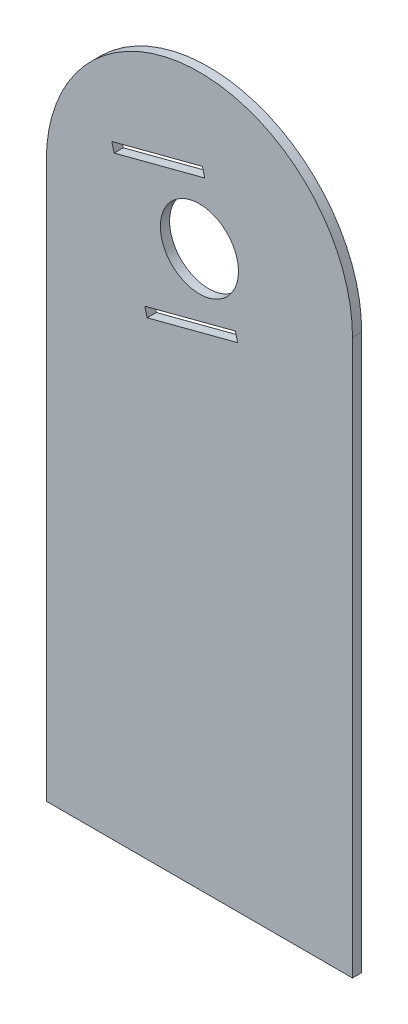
ISO-10303-21;
HEADER;
FILE_DESCRIPTION(('STEP AP214'),'2;1');
FILE_NAME('part.step','',(''),(''),'','','');
FILE_SCHEMA(('AUTOMOTIVE_DESIGN { 1 0 10303 214 1 1 1 1 }'));
ENDSEC;
DATA;
#1=APPLICATION_CONTEXT('core data for automotive mechanical design processes');
#2=APPLICATION_PROTOCOL_DEFINITION('international standard','automotive_design',2000,#1);
#3=PRODUCT_CONTEXT('',#1,'mechanical');
#4=PRODUCT('Part','Part','',(#3));
#5=PRODUCT_RELATED_PRODUCT_CATEGORY('part','',(#4));
#6=PRODUCT_DEFINITION_FORMATION('','',#4);
#7=PRODUCT_DEFINITION_CONTEXT('part definition',#1,'design');
#8=PRODUCT_DEFINITION('design','',#6,#7);
#9=PRODUCT_DEFINITION_SHAPE('','',#8);
#10=(LENGTH_UNIT() NAMED_UNIT(*) SI_UNIT(.MILLI.,.METRE.));
#11=(NAMED_UNIT(*) PLANE_ANGLE_UNIT() SI_UNIT($,.RADIAN.));
#12=(NAMED_UNIT(*) SI_UNIT($,.STERADIAN.) SOLID_ANGLE_UNIT());
#13=UNCERTAINTY_MEASURE_WITH_UNIT(LENGTH_MEASURE(1.E-05),#10,'distance_accuracy_value','');
#14=(GEOMETRIC_REPRESENTATION_CONTEXT(3) GLOBAL_UNCERTAINTY_ASSIGNED_CONTEXT((#13)) GLOBAL_UNIT_ASSIGNED_CONTEXT((#10,
#11,#12)) REPRESENTATION_CONTEXT('',''));
#15=CARTESIAN_POINT('',(0.,0.,0.));
#16=DIRECTION('',(0.,0.,1.));
#17=DIRECTION('',(1.,0.,0.));
#18=AXIS2_PLACEMENT_3D('',#15,#16,#17);
#19=CARTESIAN_POINT('',(-59.4530686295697,-35.0116548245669,1.524));
#20=DIRECTION('',(0.,0.,1.));
#21=DIRECTION('',(1.,0.,0.));
#22=AXIS2_PLACEMENT_3D('',#19,#20,#21);
#23=PLANE('',#22);
#24=DIRECTION('',(0.253234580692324,-0.967404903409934,0.));
#25=VECTOR('',#24,1.);
#26=CARTESIAN_POINT('',(-73.9882357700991,-26.8477322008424,1.524));
#27=LINE('',#26,#25);
#28=CARTESIAN_POINT('',(-73.9882357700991,-26.8477322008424,1.524));
#29=VERTEX_POINT('',#28);
#30=CARTESIAN_POINT('',(-73.602306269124,-28.3220572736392,1.524));
#31=VERTEX_POINT('',#30);
#32=EDGE_CURVE('E159',#29,#31,#27,.T.);
#33=ORIENTED_EDGE('',*,*,#32,.F.);
#34=DIRECTION('',(-0.967404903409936,-0.253234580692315,0.));
#35=VECTOR('',#34,1.);
#36=CARTESIAN_POINT('',(-58.9582136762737,-22.9133699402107,1.524));
#37=LINE('',#36,#35);
#38=CARTESIAN_POINT('',(-58.9582136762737,-22.9133699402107,1.524));
#39=VERTEX_POINT('',#38);
#40=EDGE_CURVE('E157',#39,#29,#37,.T.);
#41=ORIENTED_EDGE('',*,*,#40,.F.);
#42=DIRECTION('',(-0.253234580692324,0.967404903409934,0.));
#43=VECTOR('',#42,1.);
#44=CARTESIAN_POINT('',(-58.5722841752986,-24.3876950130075,1.524));
#45=LINE('',#44,#43);
#46=CARTESIAN_POINT('',(-58.5722841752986,-24.3876950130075,1.524));
#47=VERTEX_POINT('',#46);
#48=EDGE_CURVE('E165',#47,#39,#45,.T.);
#49=ORIENTED_EDGE('',*,*,#48,.F.);
#50=DIRECTION('',(0.967404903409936,0.253234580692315,0.));
#51=VECTOR('',#50,1.);
#52=CARTESIAN_POINT('',(-73.602306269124,-28.3220572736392,1.524));
#53=LINE('',#52,#51);
#54=EDGE_CURVE('E162',#31,#47,#53,.T.);
#55=ORIENTED_EDGE('',*,*,#54,.F.);
#56=EDGE_LOOP('',(#33,#41,#49,#55));
#57=FACE_BOUND('',#56,.T.);
#58=CARTESIAN_POINT('',(-59.4530686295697,-35.0116548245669,1.524));
#59=DIRECTION('',(0.,0.,1.));
#60=DIRECTION('',(1.,0.,0.));
#61=AXIS2_PLACEMENT_3D('',#58,#59,#60);
#62=CIRCLE('',#61,25.4);
#63=CARTESIAN_POINT('',(-34.0530686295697,-35.0116548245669,1.524));
#64=VERTEX_POINT('',#63);
#65=CARTESIAN_POINT('',(-84.8530686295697,-35.0116548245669,1.524));
#66=VERTEX_POINT('',#65);
#67=EDGE_CURVE('E194',#64,#66,#62,.T.);
#68=ORIENTED_EDGE('',*,*,#67,.T.);
#69=DIRECTION('',(0.,-1.,0.));
#70=VECTOR('',#69,1.);
#71=CARTESIAN_POINT('',(-84.8530686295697,-35.0116548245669,1.524));
#72=LINE('',#71,#70);
#73=CARTESIAN_POINT('',(-84.8530686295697,-127.07412463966,1.524));
#74=VERTEX_POINT('',#73);
#75=EDGE_CURVE('E197',#66,#74,#72,.T.);
#76=ORIENTED_EDGE('',*,*,#75,.T.);
#77=DIRECTION('',(1.,0.,0.));
#78=VECTOR('',#77,1.);
#79=CARTESIAN_POINT('',(-34.0530686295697,-127.07412463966,1.524));
#80=LINE('',#79,#78);
#81=CARTESIAN_POINT('',(-34.0530686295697,-127.07412463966,1.524));
#82=VERTEX_POINT('',#81);
#83=EDGE_CURVE('E200',#74,#82,#80,.T.);
#84=ORIENTED_EDGE('',*,*,#83,.T.);
#85=DIRECTION('',(0.,1.,0.));
#86=VECTOR('',#85,1.);
#87=CARTESIAN_POINT('',(-34.0530686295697,-35.0116548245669,1.524));
#88=LINE('',#87,#86);
#89=EDGE_CURVE('E202',#82,#64,#88,.T.);
#90=ORIENTED_EDGE('',*,*,#89,.T.);
#91=EDGE_LOOP('',(#68,#76,#84,#90));
#92=FACE_BOUND('',#91,.T.);
#93=CARTESIAN_POINT('',(-59.4530686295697,-35.0116548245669,1.524));
#94=DIRECTION('',(0.,0.,1.));
#95=DIRECTION('',(1.,0.,0.));
#96=AXIS2_PLACEMENT_3D('',#93,#94,#95);
#97=CIRCLE('',#96,6.477);
#98=CARTESIAN_POINT('',(-65.9300686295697,-35.0116548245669,1.524));
#99=VERTEX_POINT('',#98);
#100=EDGE_CURVE('E188',#99,#99,#97,.T.);
#101=ORIENTED_EDGE('',*,*,#100,.F.);
#102=EDGE_LOOP('',(#101));
#103=FACE_BOUND('',#102,.T.);
#104=DIRECTION('',(-0.253234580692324,0.967404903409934,0.));
#105=VECTOR('',#104,1.);
#106=CARTESIAN_POINT('',(-53.0939968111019,-45.3158085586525,1.524));
#107=LINE('',#106,#105);
#108=CARTESIAN_POINT('',(-53.0939968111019,-45.3158085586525,1.524));
#109=VERTEX_POINT('',#108);
#110=CARTESIAN_POINT('',(-53.479926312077,-43.8414834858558,1.524));
#111=VERTEX_POINT('',#110);
#112=EDGE_CURVE('E129',#109,#111,#107,.T.);
#113=ORIENTED_EDGE('',*,*,#112,.F.);
#114=DIRECTION('',(0.967404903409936,0.253234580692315,0.));
#115=VECTOR('',#114,1.);
#116=CARTESIAN_POINT('',(-68.1240189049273,-49.2501708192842,1.524));
#117=LINE('',#116,#115);
#118=CARTESIAN_POINT('',(-68.1240189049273,-49.2501708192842,1.524));
#119=VERTEX_POINT('',#118);
#120=EDGE_CURVE('E121',#119,#109,#117,.T.);
#121=ORIENTED_EDGE('',*,*,#120,.F.);
#122=DIRECTION('',(0.253234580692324,-0.967404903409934,0.));
#123=VECTOR('',#122,1.);
#124=CARTESIAN_POINT('',(-68.5099484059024,-47.7758457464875,1.524));
#125=LINE('',#124,#123);
#126=CARTESIAN_POINT('',(-68.5099484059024,-47.7758457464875,1.524));
#127=VERTEX_POINT('',#126);
#128=EDGE_CURVE('E143',#127,#119,#125,.T.);
#129=ORIENTED_EDGE('',*,*,#128,.F.);
#130=DIRECTION('',(-0.967404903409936,-0.253234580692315,0.));
#131=VECTOR('',#130,1.);
#132=CARTESIAN_POINT('',(-53.479926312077,-43.8414834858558,1.524));
#133=LINE('',#132,#131);
#134=EDGE_CURVE('E141',#111,#127,#133,.T.);
#135=ORIENTED_EDGE('',*,*,#134,.F.);
#136=EDGE_LOOP('',(#113,#121,#129,#135));
#137=FACE_BOUND('',#136,.T.);
#138=ADVANCED_FACE('F32',(#57,#92,#103,#137),#23,.T.);
#139=CARTESIAN_POINT('',(-59.4530686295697,-35.0116548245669,0.));
#140=DIRECTION('',(0.,0.,1.));
#141=DIRECTION('',(1.,0.,0.));
#142=AXIS2_PLACEMENT_3D('',#139,#140,#141);
#143=PLANE('',#142);
#144=DIRECTION('',(-0.967404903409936,-0.253234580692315,0.));
#145=VECTOR('',#144,1.);
#146=CARTESIAN_POINT('',(-58.9582136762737,-22.9133699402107,0.));
#147=LINE('',#146,#145);
#148=CARTESIAN_POINT('',(-58.9582136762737,-22.9133699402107,0.));
#149=VERTEX_POINT('',#148);
#150=CARTESIAN_POINT('',(-73.9882357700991,-26.8477322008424,0.));
#151=VERTEX_POINT('',#150);
#152=EDGE_CURVE('E137',#149,#151,#147,.T.);
#153=ORIENTED_EDGE('',*,*,#152,.T.);
#154=DIRECTION('',(0.253234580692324,-0.967404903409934,0.));
#155=VECTOR('',#154,1.);
#156=CARTESIAN_POINT('',(-73.9882357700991,-26.8477322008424,0.));
#157=LINE('',#156,#155);
#158=CARTESIAN_POINT('',(-73.602306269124,-28.3220572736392,0.));
#159=VERTEX_POINT('',#158);
#160=EDGE_CURVE('E170',#151,#159,#157,.T.);
#161=ORIENTED_EDGE('',*,*,#160,.T.);
#162=DIRECTION('',(0.967404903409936,0.253234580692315,0.));
#163=VECTOR('',#162,1.);
#164=CARTESIAN_POINT('',(-73.602306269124,-28.3220572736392,0.));
#165=LINE('',#164,#163);
#166=CARTESIAN_POINT('',(-58.5722841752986,-24.3876950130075,0.));
#167=VERTEX_POINT('',#166);
#168=EDGE_CURVE('E173',#159,#167,#165,.T.);
#169=ORIENTED_EDGE('',*,*,#168,.T.);
#170=DIRECTION('',(-0.253234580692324,0.967404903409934,0.));
#171=VECTOR('',#170,1.);
#172=CARTESIAN_POINT('',(-58.5722841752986,-24.3876950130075,0.));
#173=LINE('',#172,#171);
#174=EDGE_CURVE('E160',#167,#149,#173,.T.);
#175=ORIENTED_EDGE('',*,*,#174,.T.);
#176=EDGE_LOOP('',(#153,#161,#169,#175));
#177=FACE_BOUND('',#176,.T.);
#178=CARTESIAN_POINT('',(-59.4530686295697,-35.0116548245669,0.));
#179=DIRECTION('',(0.,0.,1.));
#180=DIRECTION('',(1.,0.,0.));
#181=AXIS2_PLACEMENT_3D('',#178,#179,#180);
#182=CIRCLE('',#181,25.4);
#183=CARTESIAN_POINT('',(-34.0530686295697,-35.0116548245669,0.));
#184=VERTEX_POINT('',#183);
#185=CARTESIAN_POINT('',(-84.8530686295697,-35.0116548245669,0.));
#186=VERTEX_POINT('',#185);
#187=EDGE_CURVE('E191',#184,#186,#182,.T.);
#188=ORIENTED_EDGE('',*,*,#187,.F.);
#189=DIRECTION('',(0.,1.,0.));
#190=VECTOR('',#189,1.);
#191=CARTESIAN_POINT('',(-34.0530686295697,-35.0116548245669,0.));
#192=LINE('',#191,#190);
#193=CARTESIAN_POINT('',(-34.0530686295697,-127.07412463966,0.));
#194=VERTEX_POINT('',#193);
#195=EDGE_CURVE('E198',#194,#184,#192,.T.);
#196=ORIENTED_EDGE('',*,*,#195,.F.);
#197=DIRECTION('',(1.,0.,0.));
#198=VECTOR('',#197,1.);
#199=CARTESIAN_POINT('',(-34.0530686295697,-127.07412463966,0.));
#200=LINE('',#199,#198);
#201=CARTESIAN_POINT('',(-84.8530686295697,-127.07412463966,0.));
#202=VERTEX_POINT('',#201);
#203=EDGE_CURVE('E209',#202,#194,#200,.T.);
#204=ORIENTED_EDGE('',*,*,#203,.F.);
#205=DIRECTION('',(0.,-1.,0.));
#206=VECTOR('',#205,1.);
#207=CARTESIAN_POINT('',(-84.8530686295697,-35.0116548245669,0.));
#208=LINE('',#207,#206);
#209=EDGE_CURVE('E207',#186,#202,#208,.T.);
#210=ORIENTED_EDGE('',*,*,#209,.F.);
#211=EDGE_LOOP('',(#188,#196,#204,#210));
#212=FACE_BOUND('',#211,.T.);
#213=CARTESIAN_POINT('',(-59.4530686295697,-35.0116548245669,0.));
#214=DIRECTION('',(0.,0.,1.));
#215=DIRECTION('',(1.,0.,0.));
#216=AXIS2_PLACEMENT_3D('',#213,#214,#215);
#217=CIRCLE('',#216,6.477);
#218=CARTESIAN_POINT('',(-65.9300686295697,-35.0116548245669,0.));
#219=VERTEX_POINT('',#218);
#220=EDGE_CURVE('E187',#219,#219,#217,.T.);
#221=ORIENTED_EDGE('',*,*,#220,.T.);
#222=EDGE_LOOP('',(#221));
#223=FACE_BOUND('',#222,.T.);
#224=DIRECTION('',(0.967404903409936,0.253234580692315,0.));
#225=VECTOR('',#224,1.);
#226=CARTESIAN_POINT('',(-68.1240189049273,-49.2501708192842,0.));
#227=LINE('',#226,#225);
#228=CARTESIAN_POINT('',(-68.1240189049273,-49.2501708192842,0.));
#229=VERTEX_POINT('',#228);
#230=CARTESIAN_POINT('',(-53.0939968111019,-45.3158085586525,0.));
#231=VERTEX_POINT('',#230);
#232=EDGE_CURVE('E55',#229,#231,#227,.T.);
#233=ORIENTED_EDGE('',*,*,#232,.T.);
#234=DIRECTION('',(-0.253234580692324,0.967404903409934,0.));
#235=VECTOR('',#234,1.);
#236=CARTESIAN_POINT('',(-53.0939968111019,-45.3158085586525,0.));
#237=LINE('',#236,#235);
#238=CARTESIAN_POINT('',(-53.479926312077,-43.8414834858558,0.));
#239=VERTEX_POINT('',#238);
#240=EDGE_CURVE('E136',#231,#239,#237,.T.);
#241=ORIENTED_EDGE('',*,*,#240,.T.);
#242=DIRECTION('',(-0.967404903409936,-0.253234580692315,0.));
#243=VECTOR('',#242,1.);
#244=CARTESIAN_POINT('',(-53.479926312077,-43.8414834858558,0.));
#245=LINE('',#244,#243);
#246=CARTESIAN_POINT('',(-68.5099484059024,-47.7758457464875,0.));
#247=VERTEX_POINT('',#246);
#248=EDGE_CURVE('E149',#239,#247,#245,.T.);
#249=ORIENTED_EDGE('',*,*,#248,.T.);
#250=DIRECTION('',(0.253234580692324,-0.967404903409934,0.));
#251=VECTOR('',#250,1.);
#252=CARTESIAN_POINT('',(-68.5099484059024,-47.7758457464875,0.));
#253=LINE('',#252,#251);
#254=EDGE_CURVE('E130',#247,#229,#253,.T.);
#255=ORIENTED_EDGE('',*,*,#254,.T.);
#256=EDGE_LOOP('',(#233,#241,#249,#255));
#257=FACE_BOUND('',#256,.T.);
#258=ADVANCED_FACE('F227',(#177,#212,#223,#257),#143,.F.);
#259=CARTESIAN_POINT('',(-59.4530686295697,-35.0116548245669,1.524));
#260=DIRECTION('',(0.,0.,-1.));
#261=DIRECTION('',(-1.,0.,0.));
#262=AXIS2_PLACEMENT_3D('',#259,#260,#261);
#263=CYLINDRICAL_SURFACE('',#262,25.4);
#264=ORIENTED_EDGE('',*,*,#187,.T.);
#265=DIRECTION('',(0.,0.,-1.));
#266=VECTOR('',#265,1.);
#267=CARTESIAN_POINT('',(-84.8530686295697,-35.0116548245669,1.524));
#268=LINE('',#267,#266);
#269=EDGE_CURVE('E11',#66,#186,#268,.T.);
#270=ORIENTED_EDGE('',*,*,#269,.F.);
#271=ORIENTED_EDGE('',*,*,#67,.F.);
#272=DIRECTION('',(0.,0.,-1.));
#273=VECTOR('',#272,1.);
#274=CARTESIAN_POINT('',(-34.0530686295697,-35.0116548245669,1.524));
#275=LINE('',#274,#273);
#276=EDGE_CURVE('E204',#64,#184,#275,.T.);
#277=ORIENTED_EDGE('',*,*,#276,.T.);
#278=EDGE_LOOP('',(#264,#270,#271,#277));
#279=FACE_BOUND('',#278,.T.);
#280=ADVANCED_FACE('F34',(#279),#263,.T.);
#281=CARTESIAN_POINT('',(-84.8530686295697,-35.0116548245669,1.524));
#282=DIRECTION('',(1.,0.,0.));
#283=DIRECTION('',(0.,0.,-1.));
#284=AXIS2_PLACEMENT_3D('',#281,#282,#283);
#285=PLANE('',#284);
#286=ORIENTED_EDGE('',*,*,#209,.T.);
#287=DIRECTION('',(0.,0.,-1.));
#288=VECTOR('',#287,1.);
#289=CARTESIAN_POINT('',(-84.8530686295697,-127.07412463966,1.524));
#290=LINE('',#289,#288);
#291=EDGE_CURVE('E40',#74,#202,#290,.T.);
#292=ORIENTED_EDGE('',*,*,#291,.F.);
#293=ORIENTED_EDGE('',*,*,#75,.F.);
#294=ORIENTED_EDGE('',*,*,#269,.T.);
#295=EDGE_LOOP('',(#286,#292,#293,#294));
#296=FACE_BOUND('',#295,.T.);
#297=ADVANCED_FACE('F238',(#296),#285,.F.);
#298=CARTESIAN_POINT('',(-34.0530686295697,-127.07412463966,1.524));
#299=DIRECTION('',(0.,1.,0.));
#300=DIRECTION('',(0.,0.,1.));
#301=AXIS2_PLACEMENT_3D('',#298,#299,#300);
#302=PLANE('',#301);
#303=ORIENTED_EDGE('',*,*,#203,.T.);
#304=DIRECTION('',(0.,0.,-1.));
#305=VECTOR('',#304,1.);
#306=CARTESIAN_POINT('',(-34.0530686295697,-127.07412463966,1.524));
#307=LINE('',#306,#305);
#308=EDGE_CURVE('E214',#82,#194,#307,.T.);
#309=ORIENTED_EDGE('',*,*,#308,.F.);
#310=ORIENTED_EDGE('',*,*,#83,.F.);
#311=ORIENTED_EDGE('',*,*,#291,.T.);
#312=EDGE_LOOP('',(#303,#309,#310,#311));
#313=FACE_BOUND('',#312,.T.);
#314=ADVANCED_FACE('F221',(#313),#302,.F.);
#315=CARTESIAN_POINT('',(-34.0530686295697,-35.0116548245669,1.524));
#316=DIRECTION('',(-1.,0.,0.));
#317=DIRECTION('',(0.,0.,1.));
#318=AXIS2_PLACEMENT_3D('',#315,#316,#317);
#319=PLANE('',#318);
#320=ORIENTED_EDGE('',*,*,#195,.T.);
#321=ORIENTED_EDGE('',*,*,#276,.F.);
#322=ORIENTED_EDGE('',*,*,#89,.F.);
#323=ORIENTED_EDGE('',*,*,#308,.T.);
#324=EDGE_LOOP('',(#320,#321,#322,#323));
#325=FACE_BOUND('',#324,.T.);
#326=ADVANCED_FACE('F231',(#325),#319,.F.);
#327=CARTESIAN_POINT('',(-59.4530686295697,-35.0116548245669,1.524));
#328=DIRECTION('',(0.,0.,-1.));
#329=DIRECTION('',(-1.,0.,0.));
#330=AXIS2_PLACEMENT_3D('',#327,#328,#329);
#331=CYLINDRICAL_SURFACE('',#330,6.477);
#332=CARTESIAN_POINT('',(-65.9300686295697,-35.0116548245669,1.524));
#333=CARTESIAN_POINT('',(-65.9300686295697,-35.0116548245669,1.508125));
#334=CARTESIAN_POINT('',(-65.9300686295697,-35.0116548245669,1.49225));
#335=CARTESIAN_POINT('',(-65.9300686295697,-35.0116548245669,1.4605));
#336=CARTESIAN_POINT('',(-65.9300686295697,-35.0116548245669,1.444625));
#337=CARTESIAN_POINT('',(-65.9300686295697,-35.0116548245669,1.412875));
#338=CARTESIAN_POINT('',(-65.9300686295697,-35.0116548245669,1.397));
#339=CARTESIAN_POINT('',(-65.9300686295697,-35.0116548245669,1.36525));
#340=CARTESIAN_POINT('',(-65.9300686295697,-35.0116548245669,1.349375));
#341=CARTESIAN_POINT('',(-65.9300686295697,-35.0116548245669,1.317625));
#342=CARTESIAN_POINT('',(-65.9300686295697,-35.0116548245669,1.30175));
#343=CARTESIAN_POINT('',(-65.9300686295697,-35.0116548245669,1.27));
#344=CARTESIAN_POINT('',(-65.9300686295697,-35.0116548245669,1.254125));
#345=CARTESIAN_POINT('',(-65.9300686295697,-35.0116548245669,1.222375));
#346=CARTESIAN_POINT('',(-65.9300686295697,-35.0116548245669,1.2065));
#347=CARTESIAN_POINT('',(-65.9300686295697,-35.0116548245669,1.17475));
#348=CARTESIAN_POINT('',(-65.9300686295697,-35.0116548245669,1.158875));
#349=CARTESIAN_POINT('',(-65.9300686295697,-35.0116548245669,1.127125));
#350=CARTESIAN_POINT('',(-65.9300686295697,-35.0116548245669,1.11125));
#351=CARTESIAN_POINT('',(-65.9300686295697,-35.0116548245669,1.0795));
#352=CARTESIAN_POINT('',(-65.9300686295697,-35.0116548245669,1.063625));
#353=CARTESIAN_POINT('',(-65.9300686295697,-35.0116548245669,1.031875));
#354=CARTESIAN_POINT('',(-65.9300686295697,-35.0116548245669,1.016));
#355=CARTESIAN_POINT('',(-65.9300686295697,-35.0116548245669,0.98425));
#356=CARTESIAN_POINT('',(-65.9300686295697,-35.0116548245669,0.968375));
#357=CARTESIAN_POINT('',(-65.9300686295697,-35.0116548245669,0.936625));
#358=CARTESIAN_POINT('',(-65.9300686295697,-35.0116548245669,0.92075));
#359=CARTESIAN_POINT('',(-65.9300686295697,-35.0116548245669,0.889));
#360=CARTESIAN_POINT('',(-65.9300686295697,-35.0116548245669,0.873125));
#361=CARTESIAN_POINT('',(-65.9300686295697,-35.0116548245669,0.841375));
#362=CARTESIAN_POINT('',(-65.9300686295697,-35.0116548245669,0.8255));
#363=CARTESIAN_POINT('',(-65.9300686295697,-35.0116548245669,0.79375));
#364=CARTESIAN_POINT('',(-65.9300686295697,-35.0116548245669,0.777875));
#365=CARTESIAN_POINT('',(-65.9300686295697,-35.0116548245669,0.746125));
#366=CARTESIAN_POINT('',(-65.9300686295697,-35.0116548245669,0.73025));
#367=CARTESIAN_POINT('',(-65.9300686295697,-35.0116548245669,0.6985));
#368=CARTESIAN_POINT('',(-65.9300686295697,-35.0116548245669,0.682625));
#369=CARTESIAN_POINT('',(-65.9300686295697,-35.0116548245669,0.650875));
#370=CARTESIAN_POINT('',(-65.9300686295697,-35.0116548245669,0.635));
#371=CARTESIAN_POINT('',(-65.9300686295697,-35.0116548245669,0.60325));
#372=CARTESIAN_POINT('',(-65.9300686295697,-35.0116548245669,0.587375));
#373=CARTESIAN_POINT('',(-65.9300686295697,-35.0116548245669,0.555625));
#374=CARTESIAN_POINT('',(-65.9300686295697,-35.0116548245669,0.53975));
#375=CARTESIAN_POINT('',(-65.9300686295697,-35.0116548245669,0.508));
#376=CARTESIAN_POINT('',(-65.9300686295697,-35.0116548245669,0.492125));
#377=CARTESIAN_POINT('',(-65.9300686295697,-35.0116548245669,0.460375));
#378=CARTESIAN_POINT('',(-65.9300686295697,-35.0116548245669,0.4445));
#379=CARTESIAN_POINT('',(-65.9300686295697,-35.0116548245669,0.41275));
#380=CARTESIAN_POINT('',(-65.9300686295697,-35.0116548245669,0.396875));
#381=CARTESIAN_POINT('',(-65.9300686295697,-35.0116548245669,0.365125));
#382=CARTESIAN_POINT('',(-65.9300686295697,-35.0116548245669,0.34925));
#383=CARTESIAN_POINT('',(-65.9300686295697,-35.0116548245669,0.3175));
#384=CARTESIAN_POINT('',(-65.9300686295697,-35.0116548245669,0.301625));
#385=CARTESIAN_POINT('',(-65.9300686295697,-35.0116548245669,0.269875));
#386=CARTESIAN_POINT('',(-65.9300686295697,-35.0116548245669,0.254));
#387=CARTESIAN_POINT('',(-65.9300686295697,-35.0116548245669,0.22225));
#388=CARTESIAN_POINT('',(-65.9300686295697,-35.0116548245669,0.206375));
#389=CARTESIAN_POINT('',(-65.9300686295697,-35.0116548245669,0.174625));
#390=CARTESIAN_POINT('',(-65.9300686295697,-35.0116548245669,0.15875));
#391=CARTESIAN_POINT('',(-65.9300686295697,-35.0116548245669,0.127));
#392=CARTESIAN_POINT('',(-65.9300686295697,-35.0116548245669,0.111125));
#393=CARTESIAN_POINT('',(-65.9300686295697,-35.0116548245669,0.079375));
#394=CARTESIAN_POINT('',(-65.9300686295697,-35.0116548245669,0.0635));
#395=CARTESIAN_POINT('',(-65.9300686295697,-35.0116548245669,0.0317499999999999));
#396=CARTESIAN_POINT('',(-65.9300686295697,-35.0116548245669,0.015875));
#397=CARTESIAN_POINT('',(-65.9300686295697,-35.0116548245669,0.));
#398=B_SPLINE_CURVE_WITH_KNOTS('',3,(#332,#333,#334,#335,#336,#337,#338,#339,#340,#341,#342,
#343,#344,#345,#346,#347,#348,#349,#350,#351,#352,#353,#354,#355,#356,#357,#358,#359,#360,#361,
#362,#363,#364,#365,#366,#367,#368,#369,#370,#371,#372,#373,#374,#375,#376,#377,#378,#379,#380,
#381,#382,#383,#384,#385,#386,#387,#388,#389,#390,#391,#392,#393,#394,#395,#396,#397),
.UNSPECIFIED.,.F.,.F.,(4,2,2,2,2,2,2,2,2,2,2,2,2,2,2,2,2,2,2,2,2,2,2,2,2,2,2,2,2,2,2,2,4),(0.,
0.0476250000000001,0.0952500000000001,0.142875,0.1905,0.238125,0.28575,0.333375,0.381,0.428625,
0.47625,0.523875,0.5715,0.619125,0.66675,0.714375,0.762,0.809625,0.85725,0.904875,0.9525,
1.000125,1.04775,1.095375,1.143,1.190625,1.23825,1.285875,1.3335,1.381125,1.42875,1.476375,
1.524),.UNSPECIFIED.);
#399=EDGE_CURVE('BSEAM255',#99,#219,#398,.T.);
#400=ORIENTED_EDGE('',*,*,#100,.T.);
#401=ORIENTED_EDGE('',*,*,#220,.F.);
#402=ORIENTED_EDGE('',*,*,#399,.T.);
#403=ORIENTED_EDGE('',*,*,#399,.F.);
#404=EDGE_LOOP('',(#400,#402,#401,#403));
#405=FACE_BOUND('',#404,.T.);
#406=ADVANCED_FACE('F255',(#405),#331,.F.);
#407=CARTESIAN_POINT('',(-58.9582136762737,-22.9133699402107,1.524));
#408=DIRECTION('',(0.253234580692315,-0.967404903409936,0.));
#409=DIRECTION('',(0.967404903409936,0.253234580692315,0.));
#410=AXIS2_PLACEMENT_3D('',#407,#408,#409);
#411=PLANE('',#410);
#412=ORIENTED_EDGE('',*,*,#152,.F.);
#413=DIRECTION('',(0.,0.,-1.));
#414=VECTOR('',#413,1.);
#415=CARTESIAN_POINT('',(-58.9582136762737,-22.9133699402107,1.524));
#416=LINE('',#415,#414);
#417=EDGE_CURVE('E167',#39,#149,#416,.T.);
#418=ORIENTED_EDGE('',*,*,#417,.F.);
#419=ORIENTED_EDGE('',*,*,#40,.T.);
#420=DIRECTION('',(0.,0.,-1.));
#421=VECTOR('',#420,1.);
#422=CARTESIAN_POINT('',(-73.9882357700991,-26.8477322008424,1.524));
#423=LINE('',#422,#421);
#424=EDGE_CURVE('E184',#29,#151,#423,.T.);
#425=ORIENTED_EDGE('',*,*,#424,.T.);
#426=EDGE_LOOP('',(#412,#418,#419,#425));
#427=FACE_BOUND('',#426,.T.);
#428=ADVANCED_FACE('F262',(#427),#411,.T.);
#429=CARTESIAN_POINT('',(-73.9882357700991,-26.8477322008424,1.524));
#430=DIRECTION('',(0.967404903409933,0.253234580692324,0.));
#431=DIRECTION('',(-0.253234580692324,0.967404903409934,0.));
#432=AXIS2_PLACEMENT_3D('',#429,#430,#431);
#433=PLANE('',#432);
#434=ORIENTED_EDGE('',*,*,#160,.F.);
#435=ORIENTED_EDGE('',*,*,#424,.F.);
#436=ORIENTED_EDGE('',*,*,#32,.T.);
#437=DIRECTION('',(0.,0.,-1.));
#438=VECTOR('',#437,1.);
#439=CARTESIAN_POINT('',(-73.602306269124,-28.3220572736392,1.524));
#440=LINE('',#439,#438);
#441=EDGE_CURVE('E182',#31,#159,#440,.T.);
#442=ORIENTED_EDGE('',*,*,#441,.T.);
#443=EDGE_LOOP('',(#434,#435,#436,#442));
#444=FACE_BOUND('',#443,.T.);
#445=ADVANCED_FACE('F267',(#444),#433,.T.);
#446=CARTESIAN_POINT('',(-73.602306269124,-28.3220572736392,1.524));
#447=DIRECTION('',(-0.253234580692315,0.967404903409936,0.));
#448=DIRECTION('',(-0.967404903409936,-0.253234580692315,0.));
#449=AXIS2_PLACEMENT_3D('',#446,#447,#448);
#450=PLANE('',#449);
#451=ORIENTED_EDGE('',*,*,#168,.F.);
#452=ORIENTED_EDGE('',*,*,#441,.F.);
#453=ORIENTED_EDGE('',*,*,#54,.T.);
#454=DIRECTION('',(0.,0.,-1.));
#455=VECTOR('',#454,1.);
#456=CARTESIAN_POINT('',(-58.5722841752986,-24.3876950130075,1.524));
#457=LINE('',#456,#455);
#458=EDGE_CURVE('E180',#47,#167,#457,.T.);
#459=ORIENTED_EDGE('',*,*,#458,.T.);
#460=EDGE_LOOP('',(#451,#452,#453,#459));
#461=FACE_BOUND('',#460,.T.);
#462=ADVANCED_FACE('F291',(#461),#450,.T.);
#463=CARTESIAN_POINT('',(-58.5722841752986,-24.3876950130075,1.524));
#464=DIRECTION('',(-0.967404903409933,-0.253234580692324,0.));
#465=DIRECTION('',(0.253234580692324,-0.967404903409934,0.));
#466=AXIS2_PLACEMENT_3D('',#463,#464,#465);
#467=PLANE('',#466);
#468=ORIENTED_EDGE('',*,*,#174,.F.);
#469=ORIENTED_EDGE('',*,*,#458,.F.);
#470=ORIENTED_EDGE('',*,*,#48,.T.);
#471=ORIENTED_EDGE('',*,*,#417,.T.);
#472=EDGE_LOOP('',(#468,#469,#470,#471));
#473=FACE_BOUND('',#472,.T.);
#474=ADVANCED_FACE('F288',(#473),#467,.T.);
#475=CARTESIAN_POINT('',(-68.1240189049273,-49.2501708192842,1.524));
#476=DIRECTION('',(-0.253234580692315,0.967404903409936,0.));
#477=DIRECTION('',(-0.967404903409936,-0.253234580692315,0.));
#478=AXIS2_PLACEMENT_3D('',#475,#476,#477);
#479=PLANE('',#478);
#480=ORIENTED_EDGE('',*,*,#232,.F.);
#481=DIRECTION('',(0.,0.,-1.));
#482=VECTOR('',#481,1.);
#483=CARTESIAN_POINT('',(-68.1240189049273,-49.2501708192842,1.524));
#484=LINE('',#483,#482);
#485=EDGE_CURVE('E125',#119,#229,#484,.T.);
#486=ORIENTED_EDGE('',*,*,#485,.F.);
#487=ORIENTED_EDGE('',*,*,#120,.T.);
#488=DIRECTION('',(0.,0.,-1.));
#489=VECTOR('',#488,1.);
#490=CARTESIAN_POINT('',(-53.0939968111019,-45.3158085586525,1.524));
#491=LINE('',#490,#489);
#492=EDGE_CURVE('E124',#109,#231,#491,.T.);
#493=ORIENTED_EDGE('',*,*,#492,.T.);
#494=EDGE_LOOP('',(#480,#486,#487,#493));
#495=FACE_BOUND('',#494,.T.);
#496=ADVANCED_FACE('F123',(#495),#479,.T.);
#497=CARTESIAN_POINT('',(-53.0939968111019,-45.3158085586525,1.524));
#498=DIRECTION('',(-0.967404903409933,-0.253234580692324,0.));
#499=DIRECTION('',(0.253234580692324,-0.967404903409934,0.));
#500=AXIS2_PLACEMENT_3D('',#497,#498,#499);
#501=PLANE('',#500);
#502=ORIENTED_EDGE('',*,*,#240,.F.);
#503=ORIENTED_EDGE('',*,*,#492,.F.);
#504=ORIENTED_EDGE('',*,*,#112,.T.);
#505=DIRECTION('',(0.,0.,-1.));
#506=VECTOR('',#505,1.);
#507=CARTESIAN_POINT('',(-53.479926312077,-43.8414834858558,1.524));
#508=LINE('',#507,#506);
#509=EDGE_CURVE('E138',#111,#239,#508,.T.);
#510=ORIENTED_EDGE('',*,*,#509,.T.);
#511=EDGE_LOOP('',(#502,#503,#504,#510));
#512=FACE_BOUND('',#511,.T.);
#513=ADVANCED_FACE('F133',(#512),#501,.T.);
#514=CARTESIAN_POINT('',(-53.479926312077,-43.8414834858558,1.524));
#515=DIRECTION('',(0.253234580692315,-0.967404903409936,0.));
#516=DIRECTION('',(0.967404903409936,0.253234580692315,0.));
#517=AXIS2_PLACEMENT_3D('',#514,#515,#516);
#518=PLANE('',#517);
#519=ORIENTED_EDGE('',*,*,#248,.F.);
#520=ORIENTED_EDGE('',*,*,#509,.F.);
#521=ORIENTED_EDGE('',*,*,#134,.T.);
#522=DIRECTION('',(0.,0.,-1.));
#523=VECTOR('',#522,1.);
#524=CARTESIAN_POINT('',(-68.5099484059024,-47.7758457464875,1.524));
#525=LINE('',#524,#523);
#526=EDGE_CURVE('E47',#127,#247,#525,.T.);
#527=ORIENTED_EDGE('',*,*,#526,.T.);
#528=EDGE_LOOP('',(#519,#520,#521,#527));
#529=FACE_BOUND('',#528,.T.);
#530=ADVANCED_FACE('F276',(#529),#518,.T.);
#531=CARTESIAN_POINT('',(-68.5099484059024,-47.7758457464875,1.524));
#532=DIRECTION('',(0.967404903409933,0.253234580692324,0.));
#533=DIRECTION('',(-0.253234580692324,0.967404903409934,0.));
#534=AXIS2_PLACEMENT_3D('',#531,#532,#533);
#535=PLANE('',#534);
#536=ORIENTED_EDGE('',*,*,#254,.F.);
#537=ORIENTED_EDGE('',*,*,#526,.F.);
#538=ORIENTED_EDGE('',*,*,#128,.T.);
#539=ORIENTED_EDGE('',*,*,#485,.T.);
#540=EDGE_LOOP('',(#536,#537,#538,#539));
#541=FACE_BOUND('',#540,.T.);
#542=ADVANCED_FACE('F274',(#541),#535,.T.);
#543=CLOSED_SHELL('',(#138,#258,#280,#297,#314,#326,#406,#428,#445,#462,#474,#496,#513,#530,#542));
#544=MANIFOLD_SOLID_BREP('B2',#543);
#545=ADVANCED_BREP_SHAPE_REPRESENTATION('',(#18,#544),#14);
#546=SHAPE_DEFINITION_REPRESENTATION(#9,#545);
ENDSEC;
END-ISO-10303-21;
